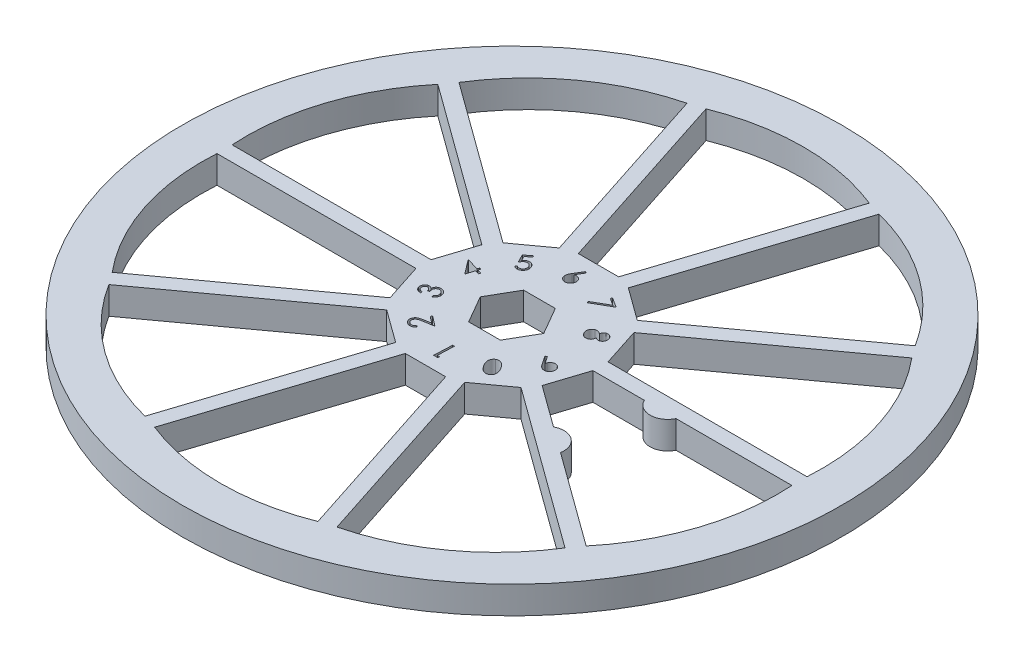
from build123d import *

# Parameters (mm, degrees)
SKETCH1_R           = 38.1
BOSS_EXTRUDE1_DEPTH = 3.175
CUT_EXTRUDE1_DEPTH  = 54.975
BOSS_EXTRUDE3_DEPTH = 3.175


with BuildPart() as part:
    # Sketch1 → Boss-Extrude1 (new body)
    with BuildSketch(Plane(origin=(0, 0, 0), x_dir=(1, 0, 0), z_dir=(0, 1, 0))):
        with Locations(Location((0, 0, 0), (0, 0, 270))):
            Circle(SKETCH1_R)
        with BuildLine():
            Line((-9.436558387, 31.874299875), (-2.329167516, 10))
            Line((-2.329167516, 10), (2.329167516, 10))
            Line((2.329167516, 10), (9.436558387, 31.874299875))
            ThreePointArc((9.436558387, 31.874299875), (0, 33.692286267), (-9.436558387, 31.874299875))
        make_face(mode=Mode.SUBTRACT)
        with BuildLine():
            Line((-3.99351642, 9.45922026), (-7.762188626, 6.721119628))
            Line((-7.762188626, 6.721119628), (-26.369579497, 20.24018043))
            ThreePointArc((-26.369579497, 20.24018043), (-19.803828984, 27.257632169), (-11.10090729, 31.333520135))
            Line((-11.10090729, 31.333520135), (-3.99351642, 9.45922026))
        make_face(mode=Mode.SUBTRACT)
        with BuildLine():
            Line((7.762188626, 6.721119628), (3.99351642, 9.45922026))
            Line((3.99351642, 9.45922026), (11.10090729, 31.333520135))
            ThreePointArc((11.10090729, 31.333520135), (19.803828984, 27.257632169), (26.369579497, 20.24018043))
            Line((26.369579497, 20.24018043), (7.762188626, 6.721119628))
        make_face(mode=Mode.SUBTRACT)
        with BuildLine():
            Line((-10.230317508, -0.875), (-8.790812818, -5.305339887))
            Line((-8.790812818, -5.305339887), (-27.398203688, -18.82440069))
            ThreePointArc((-27.398203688, -18.82440069), (-32.043268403, -10.411489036), (-33.230317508, -0.875))
            Line((-33.230317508, -0.875), (-10.230317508, -0.875))
        make_face(mode=Mode.SUBTRACT)
        with BuildLine():
            Line((8.790812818, -5.305339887), (10.230317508, -0.875))
            Line((10.230317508, -0.875), (33.230317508, -0.875))
            ThreePointArc((33.230317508, -0.875), (32.043268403, -10.411489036), (27.398203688, -18.82440069))
            Line((27.398203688, -18.82440069), (8.790812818, -5.305339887))
        make_face(mode=Mode.SUBTRACT)
        with BuildLine():
            Line((-2.329167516, -10), (2.329167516, -10))
            Line((2.329167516, -10), (9.436558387, -31.874299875))
            ThreePointArc((9.436558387, -31.874299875), (0, -33.692286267), (-9.436558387, -31.874299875))
            Line((-9.436558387, -31.874299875), (-2.329167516, -10))
        make_face(mode=Mode.SUBTRACT)
        with BuildLine():
            Line((-27.398203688, 18.82440069), (-8.790812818, 5.305339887))
            Line((-8.790812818, 5.305339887), (-10.230317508, 0.875))
            Line((-10.230317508, 0.875), (-33.230317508, 0.875))
            ThreePointArc((-33.230317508, 0.875), (-32.043268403, 10.411489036), (-27.398203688, 18.82440069))
        make_face(mode=Mode.SUBTRACT)
        with BuildLine():
            Line((-3.99351642, -9.45922026), (-7.762188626, -6.721119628))
            Line((-7.762188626, -6.721119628), (-26.369579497, -20.24018043))
            ThreePointArc((-26.369579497, -20.24018043), (-19.803828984, -27.257632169), (-11.10090729, -31.333520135))
            Line((-11.10090729, -31.333520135), (-3.99351642, -9.45922026))
        make_face(mode=Mode.SUBTRACT)
        with BuildLine():
            Line((8.790812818, 5.305339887), (10.230317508, 0.875))
            Line((10.230317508, 0.875), (33.230317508, 0.875))
            ThreePointArc((33.230317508, 0.875), (32.043268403, 10.411489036), (27.398203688, 18.82440069))
            Line((27.398203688, 18.82440069), (8.790812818, 5.305339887))
        make_face(mode=Mode.SUBTRACT)
        with BuildLine():
            Line((7.762188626, -6.721119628), (3.99351642, -9.45922026))
            Line((3.99351642, -9.45922026), (11.10090729, -31.333520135))
            ThreePointArc((11.10090729, -31.333520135), (19.803828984, -27.257632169), (26.369579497, -20.24018043))
            Line((26.369579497, -20.24018043), (7.762188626, -6.721119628))
        make_face(mode=Mode.SUBTRACT)
        Polygon((3.666174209, 0), (1.833087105, 3.175), (-1.833087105, 3.175), (-3.666174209, 0), (-1.833087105, -3.175), (1.833087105, -3.175), align=None, mode=Mode.SUBTRACT)
    extrude(amount=BOSS_EXTRUDE1_DEPTH)

    # Sketch4 → Cut-Extrude1 (cut, through all)
    # profile 1 of 10: a face of its own
    with BuildSketch(Plane(origin=(0, 3.175, 0), x_dir=(1, 0, 0), z_dir=(0, 1, 0))):
        with BuildLine():
            Line((6.008134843, -2.207274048), (6.177739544, -2.089822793))
            Line((6.177739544, -2.089822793), (6.758211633, -2.944630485))
            add(Edge.make_bspline(
                [(6.758211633, -2.944630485), (6.759998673, -2.925079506), (6.763474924, -2.887047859), (6.774121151, -2.832025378), (6.787033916, -2.780153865), (6.79957908, -2.747641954), (6.805700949, -2.731776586)],
                knots=[0, 0, 0, 0, 1.075315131, 2.091762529, 3.068806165, 4, 4, 4, 4], degree=3))
            add(Edge.make_bspline(
                [(6.805700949, -2.731776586), (6.814114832, -2.712946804), (6.830622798, -2.676002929), (6.861067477, -2.624206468), (6.895968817, -2.576829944), (6.93547794, -2.534024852), (6.979105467, -2.495536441), (7.026933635, -2.461337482), (7.079339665, -2.431783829), (7.135292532, -2.406331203), (7.193818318, -2.386944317), (7.25294362, -2.371809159), (7.312752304, -2.364676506), (7.37280331, -2.362097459), (7.433253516, -2.366845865), (7.494165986, -2.376191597), (7.555058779, -2.393146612), (7.594897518, -2.408226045), (7.615139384, -2.41588783)],
                knots=[0, 0, 0, 0, 1.022013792, 2.005182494, 2.97231041, 3.934474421, 4.887767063, 5.852327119, 6.844124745, 7.866642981, 8.894932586, 9.89776092, 10.886955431, 11.875703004, 12.873302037, 13.888324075, 14.92706791, 16, 16, 16, 16], degree=3))
            add(Edge.make_bspline(
                [(7.615139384, -2.41588783), (7.642252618, -2.427997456), (7.69550017, -2.451779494), (7.767460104, -2.499863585), (7.831918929, -2.554778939), (7.887467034, -2.617883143), (7.9344972, -2.68733619), (7.970479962, -2.763279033), (7.997382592, -2.844220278), (8.01225277, -2.929759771), (8.018329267, -3.017010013), (8.011970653, -3.103897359), (7.99559219, -3.18956788), (7.975215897, -3.244078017), (7.96494908, -3.271543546)],
                knots=[0, 0, 0, 0, 1.036517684, 2.035612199, 3.013201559, 3.989841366, 4.965618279, 5.935849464, 6.918719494, 7.938327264, 8.963189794, 9.968654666, 10.976484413, 12, 12, 12, 12], degree=3))
            add(Edge.make_bspline(
                [(7.96494908, -3.271543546), (7.953007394, -3.297601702), (7.929392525, -3.349132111), (7.883005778, -3.42015218), (7.827837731, -3.483771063), (7.764704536, -3.539697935), (7.695005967, -3.58667744), (7.619724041, -3.623714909), (7.539702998, -3.650143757), (7.455893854, -3.665037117), (7.370871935, -3.669755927), (7.286493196, -3.663939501), (7.203629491, -3.64695365), (7.150782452, -3.627680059), (7.124133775, -3.617961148)],
                knots=[0, 0, 0, 0, 1.01839986, 2.013901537, 3.004594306, 4.005222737, 5.004853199, 5.985019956, 6.980115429, 7.991731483, 9.003622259, 10.001405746, 10.99218778, 12, 12, 12, 12], degree=3))
            add(Edge.make_bspline(
                [(7.124133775, -3.617961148), (7.103996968, -3.609044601), (7.063097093, -3.590934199), (7.004458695, -3.55542633), (6.946830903, -3.513795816), (6.889198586, -3.464959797), (6.831284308, -3.406042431), (6.771386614, -3.335849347), (6.708385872, -3.253625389), (6.667446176, -3.193463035), (6.645848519, -3.161724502)],
                knots=[0, 0, 0, 0, 0.787036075, 1.59854923, 2.445988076, 3.328266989, 4.297018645, 5.397528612, 6.627071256, 8, 8, 8, 8], degree=3))
            Line((6.645848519, -3.161724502), (6.008134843, -2.207274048))
        make_face()
        with BuildLine():
            add(Edge.make_bspline(
                [(6.95834518, -2.847107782), (6.952989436, -2.861294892), (6.942472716, -2.889153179), (6.931447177, -2.932053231), (6.924479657, -2.974773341), (6.922503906, -3.017701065), (6.924432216, -3.060493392), (6.931469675, -3.103213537), (6.942557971, -3.145787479), (6.957709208, -3.187807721), (6.976574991, -3.22836067), (6.99915169, -3.265942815), (7.024219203, -3.300999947), (7.053299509, -3.332077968), (7.084809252, -3.360938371), (7.119674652, -3.386315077), (7.1576361, -3.408574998), (7.184642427, -3.420622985), (7.198335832, -3.426731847)],
                knots=[0, 0, 0, 0, 1.04241003, 2.04691155, 3.041056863, 4.014450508, 4.997553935, 5.98209837, 6.98659989, 8.019857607, 9.050596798, 10.057635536, 11.031854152, 12.008882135, 12.979358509, 13.967161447, 14.969260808, 16, 16, 16, 16], degree=3))
            add(Edge.make_bspline(
                [(7.198335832, -3.426731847), (7.212380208, -3.432084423), (7.240078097, -3.442640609), (7.282683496, -3.453715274), (7.325332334, -3.460060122), (7.367935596, -3.462185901), (7.410590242, -3.460186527), (7.453169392, -3.453186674), (7.495742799, -3.442093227), (7.537766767, -3.42694772), (7.578305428, -3.408064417), (7.616108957, -3.385448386), (7.651210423, -3.359957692), (7.683006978, -3.331063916), (7.711642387, -3.299131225), (7.736716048, -3.263819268), (7.759464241, -3.2258657), (7.771465, -3.198476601), (7.777535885, -3.184621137)],
                knots=[0, 0, 0, 0, 1.032325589, 2.035920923, 3.01808944, 3.990604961, 4.963120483, 5.946776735, 6.950372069, 7.982697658, 9.012506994, 10.018637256, 11.005549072, 11.988869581, 12.965692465, 13.946899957, 14.96138774, 16, 16, 16, 16], degree=3))
            add(Edge.make_bspline(
                [(7.777535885, -3.184621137), (7.782888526, -3.170576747), (7.793444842, -3.142878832), (7.804518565, -3.100273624), (7.810866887, -3.057624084), (7.81297986, -3.015023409), (7.811034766, -2.972498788), (7.803901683, -2.930091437), (7.793020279, -2.887543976), (7.777216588, -2.84570235), (7.758450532, -2.805086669), (7.73598684, -2.767285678), (7.710138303, -2.73274507), (7.682067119, -2.700591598), (7.649609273, -2.672704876), (7.614988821, -2.647052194), (7.576958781, -2.624864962), (7.549961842, -2.612807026), (7.536273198, -2.606693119)],
                knots=[0, 0, 0, 0, 1.035134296, 2.041460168, 3.026300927, 4.001462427, 4.976623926, 5.953340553, 6.959666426, 7.998140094, 9.030751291, 10.039618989, 11.021372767, 12.000853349, 12.97387249, 13.963469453, 14.967388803, 16, 16, 16, 16], degree=3))
            add(Edge.make_bspline(
                [(7.536273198, -2.606693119), (7.522228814, -2.601340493), (7.494530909, -2.590784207), (7.451925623, -2.579710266), (7.40927637, -2.573362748), (7.366674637, -2.571246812), (7.324153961, -2.573202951), (7.281731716, -2.580294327), (7.239289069, -2.591325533), (7.197267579, -2.606480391), (7.156723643, -2.625354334), (7.119107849, -2.647895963), (7.084249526, -2.673035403), (7.05270375, -2.701635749), (7.024303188, -2.733592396), (6.998734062, -2.768420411), (6.976509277, -2.806414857), (6.964456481, -2.833416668), (6.95834518, -2.847107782)],
                knots=[0, 0, 0, 0, 1.035774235, 2.042722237, 3.028171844, 4.003936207, 4.97970057, 5.957021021, 6.963969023, 7.999743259, 9.032992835, 10.042484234, 11.019075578, 11.991915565, 12.972001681, 13.962210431, 14.966750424, 16, 16, 16, 16], degree=3))
        make_face(mode=Mode.SUBTRACT)
    # profile 2 of 10: a face of its own
    with BuildSketch(Plane(origin=(0, 3.175, 0), x_dir=(1, 0, 0), z_dir=(0, 1, 0))):
        with BuildLine():
            add(Edge.make_bspline(
                [(4.646652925, -5.931807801), (4.664653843, -5.960382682), (4.699634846, -6.015911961), (4.747354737, -6.098619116), (4.790166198, -6.177405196), (4.826609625, -6.253248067), (4.858252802, -6.325337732), (4.883533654, -6.394290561), (4.904552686, -6.459292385), (4.918854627, -6.521510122), (4.928559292, -6.581183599), (4.935235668, -6.638614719), (4.93732577, -6.694605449), (4.935504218, -6.74883383), (4.930801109, -6.801640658), (4.921102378, -6.85256161), (4.908739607, -6.902089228), (4.891437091, -6.949348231), (4.871669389, -6.994993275), (4.848359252, -7.037995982), (4.822277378, -7.078671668), (4.793328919, -7.117034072), (4.761282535, -7.153082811), (4.725658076, -7.186019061), (4.688011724, -7.2175363), (4.660548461, -7.235754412), (4.646652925, -7.244972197)],
                knots=[0, 0, 0, 0, 1.645831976, 3.198328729, 4.653025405, 6.014789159, 7.298288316, 8.488304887, 9.592894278, 10.625525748, 11.596046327, 12.538562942, 13.441613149, 14.323771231, 15.181935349, 16.02233202, 16.84768784, 17.666926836, 18.471967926, 19.270231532, 20.04793037, 20.824957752, 21.610397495, 22.394990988, 23.187916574, 24, 24, 24, 24], degree=3))
            add(Edge.make_bspline(
                [(4.646652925, -7.244972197), (4.632210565, -7.253659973), (4.603571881, -7.270887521), (4.558936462, -7.292877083), (4.513552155, -7.31141686), (4.46682123, -7.325096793), (4.419388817, -7.336574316), (4.370656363, -7.343114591), (4.321058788, -7.345990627), (4.270734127, -7.345775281), (4.219812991, -7.341051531), (4.168660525, -7.331997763), (4.117234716, -7.318998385), (4.065880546, -7.300751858), (4.014072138, -7.279250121), (3.96212162, -7.253337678), (3.910543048, -7.222396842), (3.858035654, -7.188211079), (3.805463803, -7.14844253), (3.753195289, -7.102535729), (3.700437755, -7.051113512), (3.647904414, -6.993565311), (3.594917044, -6.93028461), (3.541542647, -6.861156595), (3.488038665, -6.78607171), (3.453708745, -6.733182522), (3.436099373, -6.70605326)],
                knots=[0, 0, 0, 0, 0.815853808, 1.617808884, 2.407075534, 3.186547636, 3.973496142, 4.768174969, 5.563560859, 6.378064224, 7.202826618, 8.036627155, 8.8915378, 9.768172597, 10.673203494, 11.606770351, 12.576348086, 13.584347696, 14.639750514, 15.765220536, 16.951028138, 18.2056322, 19.536778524, 20.946858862, 22.433905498, 24, 24, 24, 24], degree=3))
            add(Edge.make_bspline(
                [(3.436099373, -6.70605326), (3.418942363, -6.678753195), (3.385580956, -6.625668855), (3.340039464, -6.546033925), (3.299818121, -6.469043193), (3.264567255, -6.394803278), (3.233984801, -6.323432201), (3.209598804, -6.254353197), (3.189676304, -6.188096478), (3.175613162, -6.124127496), (3.166580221, -6.062444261), (3.160134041, -6.002902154), (3.15878161, -5.94509298), (3.160059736, -5.889115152), (3.166132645, -5.834970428), (3.176008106, -5.782742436), (3.188897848, -5.73196885), (3.20648032, -5.683324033), (3.227187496, -5.636704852), (3.250926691, -5.592663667), (3.27741237, -5.551018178), (3.307112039, -5.512065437), (3.339870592, -5.475496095), (3.375483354, -5.441471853), (3.414374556, -5.410343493), (3.442041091, -5.391709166), (3.456027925, -5.38228857)],
                knots=[0, 0, 0, 0, 1.562310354, 3.03787612, 4.44395277, 5.770467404, 7.019601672, 8.204525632, 9.318421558, 10.370311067, 11.374754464, 12.338370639, 13.270212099, 14.174670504, 15.049738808, 15.906744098, 16.748953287, 17.585125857, 18.409860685, 19.218832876, 20.007279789, 20.799021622, 21.589607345, 22.384069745, 23.183065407, 24, 24, 24, 24], degree=3))
            add(Edge.make_bspline(
                [(3.456027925, -5.38228857), (3.470162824, -5.373559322), (3.498234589, -5.356223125), (3.542375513, -5.334858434), (3.587289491, -5.316873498), (3.632845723, -5.302304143), (3.679602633, -5.292260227), (3.727050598, -5.285345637), (3.775552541, -5.282429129), (3.824739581, -5.283313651), (3.874519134, -5.287940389), (3.924474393, -5.296773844), (3.974358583, -5.310326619), (4.024511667, -5.32689591), (4.074164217, -5.349154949), (4.124478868, -5.374302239), (4.174255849, -5.404791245), (4.224911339, -5.43875031), (4.275625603, -5.478577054), (4.326757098, -5.524445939), (4.37876556, -5.57648179), (4.43112742, -5.635168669), (4.484587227, -5.699994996), (4.538287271, -5.771525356), (4.593131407, -5.848985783), (4.628480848, -5.903687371), (4.646652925, -5.931807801)],
                knots=[0, 0, 0, 0, 0.810485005, 1.609614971, 2.389818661, 3.17096737, 3.9409775, 4.72151665, 5.509490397, 6.3098999, 7.120649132, 7.947529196, 8.782571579, 9.642161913, 10.522704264, 11.435989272, 12.386082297, 13.369627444, 14.411590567, 15.530535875, 16.720858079, 18.000814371, 19.368238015, 20.821189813, 22.365869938, 24, 24, 24, 24], degree=3))
        make_face()
        with BuildLine():
            add(Edge.make_bspline(
                [(4.477048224, -6.03569068), (4.461336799, -6.011584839), (4.430874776, -5.964847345), (4.384673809, -5.898223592), (4.339654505, -5.837300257), (4.296712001, -5.781252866), (4.253866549, -5.731915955), (4.212529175, -5.687959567), (4.172992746, -5.649190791), (4.122303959, -5.606353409), (4.059293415, -5.562604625), (3.982412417, -5.521661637), (3.904429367, -5.494758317), (3.826538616, -5.482243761), (3.751238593, -5.481369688), (3.679737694, -5.490796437), (3.612804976, -5.511945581), (3.572716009, -5.534631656), (3.552702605, -5.545957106)],
                knots=[0, 0, 0, 0, 1.181714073, 2.291160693, 3.329086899, 4.292828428, 5.190029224, 6.011310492, 6.770753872, 7.462710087, 8.734792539, 9.913537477, 11.029615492, 12.106059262, 13.139365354, 14.112154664, 15.057540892, 16, 16, 16, 16], degree=3))
            add(Edge.make_bspline(
                [(3.552702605, -5.545957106), (3.533742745, -5.559266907), (3.495894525, -5.585836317), (3.449291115, -5.638313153), (3.409655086, -5.697727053), (3.3845157, -5.753620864), (3.369314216, -5.801765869), (3.360967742, -5.839948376), (3.355245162, -5.879484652), (3.353557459, -5.920474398), (3.353474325, -5.96287331), (3.35839661, -6.006697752), (3.36469003, -6.052122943), (3.371826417, -6.082519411), (3.375465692, -6.098020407)],
                knots=[0, 0, 0, 0, 1.339326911, 2.673603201, 4.03984646, 5.470463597, 6.209276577, 6.964946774, 7.734622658, 8.522543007, 9.342223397, 10.190421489, 11.077186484, 12, 12, 12, 12], degree=3))
            add(Edge.make_bspline(
                [(3.375465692, -6.098020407), (3.380323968, -6.117589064), (3.390191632, -6.157335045), (3.409612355, -6.216842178), (3.432615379, -6.277443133), (3.458868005, -6.339282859), (3.488677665, -6.402245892), (3.522143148, -6.466212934), (3.559602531, -6.531121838), (3.586495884, -6.574263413), (3.600191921, -6.596234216)],
                knots=[0, 0, 0, 0, 0.881068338, 1.78954166, 2.733856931, 3.713774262, 4.725199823, 5.77800347, 6.868398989, 8, 8, 8, 8], degree=3))
            add(Edge.make_bspline(
                [(3.600191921, -6.596234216), (3.614348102, -6.617938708), (3.64197834, -6.660301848), (3.684447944, -6.721027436), (3.726719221, -6.777700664), (3.769667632, -6.829461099), (3.811504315, -6.877946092), (3.854128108, -6.921512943), (3.896182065, -6.961411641), (3.938483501, -6.996813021), (3.980402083, -7.028214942), (4.021929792, -7.05574057), (4.062824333, -7.079839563), (4.103521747, -7.099803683), (4.14398596, -7.115877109), (4.183669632, -7.128911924), (4.223215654, -7.13732462), (4.274252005, -7.144086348), (4.336254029, -7.144204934), (4.407123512, -7.134105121), (4.473771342, -7.113837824), (4.513310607, -7.090993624), (4.533017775, -7.079607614)],
                knots=[0, 0, 0, 0, 1.330078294, 2.596065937, 3.80331419, 4.957991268, 6.047946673, 7.089475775, 8.085195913, 9.022479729, 9.919210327, 10.772385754, 11.578713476, 12.354194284, 13.096521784, 13.81239025, 14.49544863, 15.168571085, 16.45274294, 17.662430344, 18.834908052, 20, 20, 20, 20], degree=3))
            add(Edge.make_bspline(
                [(4.533017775, -7.079607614), (4.551939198, -7.066264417), (4.589789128, -7.039573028), (4.637042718, -6.987472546), (4.67612162, -6.927149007), (4.70103527, -6.870696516), (4.716800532, -6.822117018), (4.725744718, -6.78368549), (4.731007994, -6.74378164), (4.734255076, -6.702717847), (4.733538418, -6.660196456), (4.730294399, -6.616254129), (4.723186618, -6.571169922), (4.713968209, -6.524204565), (4.700519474, -6.474910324), (4.68273882, -6.422299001), (4.659460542, -6.366514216), (4.632391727, -6.307004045), (4.60027979, -6.244212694), (4.563955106, -6.177582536), (4.522113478, -6.107775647), (4.492391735, -6.060233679), (4.477048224, -6.03569068)],
                knots=[0, 0, 0, 0, 1.185349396, 2.371142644, 3.582401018, 4.861775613, 5.524760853, 6.202231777, 6.88342084, 7.58889689, 8.314341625, 9.063762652, 9.848579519, 10.655219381, 11.519217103, 12.46892058, 13.503486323, 14.620144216, 15.823732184, 17.122294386, 18.514417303, 20, 20, 20, 20], degree=3))
        make_face(mode=Mode.SUBTRACT)
    # profile 3 of 10: a face of its own
    with BuildSketch(Plane(origin=(0, 3.175, 0), x_dir=(1, 0, 0), z_dir=(0, 1, 0))):
        Polygon((-0.096389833, -8.560304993), (-0.510225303, -8.542920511), (-0.421606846, -6.437702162), (-0.212569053, -6.446606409), (-0.292283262, -8.345755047), (0.038445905, -8.359747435), align=None)
    # profile 4 of 10: a face of its own
    with BuildSketch(Plane(origin=(0, 3.175, 0), x_dir=(1, 0, 0), z_dir=(0, 1, 0))):
        with BuildLine():
            Line((-4.432784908, -6.555224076), (-4.272084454, -6.678611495))
            add(Edge.make_bspline(
                [(-4.272084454, -6.678611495), (-4.288747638, -6.698101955), (-4.32139403, -6.736287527), (-4.374584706, -6.788037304), (-4.430999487, -6.832573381), (-4.489513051, -6.871705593), (-4.551289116, -6.903333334), (-4.615371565, -6.929164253), (-4.682189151, -6.948162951), (-4.750905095, -6.960833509), (-4.820208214, -6.966758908), (-4.888667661, -6.965995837), (-4.955750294, -6.958369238), (-5.021160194, -6.943747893), (-5.085314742, -6.923145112), (-5.147303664, -6.894517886), (-5.208611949, -6.86039639), (-5.246882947, -6.832388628), (-5.266392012, -6.818111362)],
                knots=[0, 0, 0, 0, 1.100149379, 2.155404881, 3.178494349, 4.181169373, 5.171382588, 6.151324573, 7.141983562, 8.147297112, 9.145688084, 10.122339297, 11.080890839, 12.037502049, 12.994670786, 13.966544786, 14.963423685, 16, 16, 16, 16], degree=3))
            add(Edge.make_bspline(
                [(-5.266392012, -6.818111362), (-5.284896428, -6.803157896), (-5.321055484, -6.773937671), (-5.36973623, -6.725642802), (-5.41205071, -6.674813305), (-5.447107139, -6.620795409), (-5.477525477, -6.565190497), (-5.5001583, -6.506349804), (-5.517019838, -6.44515282), (-5.526781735, -6.381980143), (-5.531141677, -6.318543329), (-5.52931742, -6.256102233), (-5.5223844, -6.195408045), (-5.508956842, -6.136542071), (-5.490389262, -6.079329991), (-5.465435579, -6.02412847), (-5.435477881, -5.970182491), (-5.411061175, -5.936636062), (-5.398683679, -5.919630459)],
                knots=[0, 0, 0, 0, 1.125548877, 2.199409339, 3.240166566, 4.24957425, 5.243251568, 6.234651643, 7.22627742, 8.242556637, 9.254974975, 10.232096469, 11.195517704, 12.141759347, 13.085324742, 14.03767207, 15.005242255, 16, 16, 16, 16], degree=3))
            add(Edge.make_bspline(
                [(-5.398683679, -5.919630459), (-5.379898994, -5.89676072), (-5.342666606, -5.851431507), (-5.276831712, -5.79317008), (-5.204684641, -5.743522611), (-5.138403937, -5.709613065), (-5.079785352, -5.686256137), (-5.029446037, -5.668512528), (-4.972972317, -5.651252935), (-4.910475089, -5.634266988), (-4.841680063, -5.617935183), (-4.766795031, -5.601372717), (-4.685785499, -5.585283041), (-4.629687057, -5.575368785), (-4.600693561, -5.570244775)],
                knots=[0, 0, 0, 0, 1.19032024, 2.359287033, 3.526020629, 4.709749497, 5.348159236, 6.06644772, 6.858627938, 7.725764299, 8.674200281, 9.705837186, 10.814302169, 12, 12, 12, 12], degree=3))
            Line((-4.600693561, -5.570244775), (-3.838320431, -5.440497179))
            Line((-3.838320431, -5.440497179), (-4.612141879, -4.846880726))
            Line((-4.612141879, -4.846880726), (-4.487906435, -4.684908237))
            Line((-4.487906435, -4.684908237), (-3.349434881, -5.558372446))
            Line((-3.349434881, -5.558372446), (-4.520131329, -5.758930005))
            add(Edge.make_bspline(
                [(-4.520131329, -5.758930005), (-4.54854643, -5.763840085), (-4.603295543, -5.773300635), (-4.681952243, -5.787498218), (-4.753765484, -5.801920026), (-4.818661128, -5.816297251), (-4.876698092, -5.830478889), (-4.927777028, -5.845129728), (-4.972237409, -5.85869336), (-5.021781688, -5.877197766), (-5.076562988, -5.903509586), (-5.135683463, -5.942107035), (-5.188994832, -5.987325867), (-5.218547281, -6.023044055), (-5.233319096, -6.04089782)],
                knots=[0, 0, 0, 0, 1.320310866, 2.543923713, 3.659492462, 4.673759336, 5.587226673, 6.394355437, 7.106613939, 7.714816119, 8.814657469, 9.880838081, 10.940735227, 12, 12, 12, 12], degree=3))
            add(Edge.make_bspline(
                [(-5.233319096, -6.04089782), (-5.24191783, -6.052743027), (-5.258886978, -6.076118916), (-5.279576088, -6.113751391), (-5.296491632, -6.152399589), (-5.30798111, -6.19271991), (-5.316947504, -6.23386884), (-5.320508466, -6.276718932), (-5.320067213, -6.320719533), (-5.315427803, -6.365447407), (-5.306532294, -6.409713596), (-5.293858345, -6.452610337), (-5.277385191, -6.493450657), (-5.256611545, -6.53213664), (-5.232226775, -6.568919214), (-5.203475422, -6.603398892), (-5.171065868, -6.636025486), (-5.146876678, -6.655514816), (-5.134524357, -6.665467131)],
                knots=[0, 0, 0, 0, 0.998093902, 1.969685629, 2.92471149, 3.87082952, 4.826196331, 5.794718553, 6.797973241, 7.825964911, 8.85887793, 9.875217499, 10.874755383, 11.858671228, 12.867290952, 13.881293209, 14.918072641, 16, 16, 16, 16], degree=3))
            add(Edge.make_bspline(
                [(-5.134524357, -6.665467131), (-5.121107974, -6.675161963), (-5.094698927, -6.694245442), (-5.053115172, -6.718546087), (-5.010432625, -6.73776632), (-4.966903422, -6.75212129), (-4.922690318, -6.76268893), (-4.877420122, -6.76741431), (-4.831406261, -6.768583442), (-4.784821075, -6.764074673), (-4.73803111, -6.755305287), (-4.691880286, -6.741237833), (-4.646557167, -6.722265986), (-4.601867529, -6.698948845), (-4.558038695, -6.670349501), (-4.515307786, -6.636456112), (-4.47258305, -6.598563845), (-4.44624936, -6.569886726), (-4.432784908, -6.555224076)],
                knots=[0, 0, 0, 0, 1.00430334, 1.976888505, 2.917624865, 3.839993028, 4.755634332, 5.670793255, 6.597460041, 7.54501695, 8.505725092, 9.482726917, 10.467307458, 11.484173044, 12.538281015, 13.638306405, 14.792462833, 16, 16, 16, 16], degree=3))
        make_face()
    # profile 5 of 10: a face of its own
    with BuildSketch(Plane(origin=(0, 3.175, 0), x_dir=(1, 0, 0), z_dir=(0, 1, 0))):
        with BuildLine():
            Line((-7.565496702, -2.829563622), (-7.501046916, -3.034361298))
            add(Edge.make_bspline(
                [(-7.501046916, -3.034361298), (-7.522803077, -3.035798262), (-7.565300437, -3.038605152), (-7.628067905, -3.03757569), (-7.688355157, -3.032805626), (-7.745989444, -3.022842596), (-7.801252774, -3.009392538), (-7.853891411, -2.991307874), (-7.903674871, -2.967944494), (-7.951144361, -2.9415616), (-7.99528649, -2.910998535), (-8.035671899, -2.876848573), (-8.072717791, -2.839848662), (-8.106327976, -2.799938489), (-8.136296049, -2.756865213), (-8.161942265, -2.710366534), (-8.184891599, -2.661079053), (-8.196478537, -2.626309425), (-8.202362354, -2.608653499)],
                knots=[0, 0, 0, 0, 1.171238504, 2.287836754, 3.370199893, 4.417814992, 5.427291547, 6.424116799, 7.402837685, 8.378843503, 9.339569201, 10.28287391, 11.217361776, 12.149964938, 13.083310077, 14.032011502, 15.000660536, 16, 16, 16, 16], degree=3))
            add(Edge.make_bspline(
                [(-8.202362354, -2.608653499), (-8.209664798, -2.582652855), (-8.224142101, -2.531105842), (-8.23413508, -2.451641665), (-8.233967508, -2.372208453), (-8.224755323, -2.29361638), (-8.206374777, -2.21760588), (-8.178727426, -2.146289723), (-8.142316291, -2.080673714), (-8.097802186, -2.021474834), (-8.04692814, -1.969471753), (-7.990648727, -1.926352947), (-7.930693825, -1.890920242), (-7.887340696, -1.875568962), (-7.865697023, -1.867904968)],
                knots=[0, 0, 0, 0, 1.075905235, 2.133012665, 3.181428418, 4.237152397, 5.28162113, 6.291729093, 7.278286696, 8.264699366, 9.23724505, 10.169628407, 11.086202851, 12, 12, 12, 12], degree=3))
            add(Edge.make_bspline(
                [(-7.865697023, -1.867904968), (-7.844348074, -1.86189963), (-7.802444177, -1.850112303), (-7.738057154, -1.843513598), (-7.674676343, -1.846053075), (-7.612164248, -1.857698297), (-7.550478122, -1.878280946), (-7.489908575, -1.908495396), (-7.4301808, -1.947739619), (-7.393010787, -1.979551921), (-7.37384339, -1.995956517)],
                knots=[0, 0, 0, 0, 0.994688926, 1.952383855, 2.892751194, 3.835366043, 4.799018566, 5.804107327, 6.867647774, 8, 8, 8, 8], degree=3))
            add(Edge.make_bspline(
                [(-7.37384339, -1.995956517), (-7.370852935, -1.96940386), (-7.364961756, -1.917095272), (-7.344384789, -1.84154662), (-7.315929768, -1.769821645), (-7.289527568, -1.726104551), (-7.276320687, -1.704236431)],
                knots=[0, 0, 0, 0, 1.030676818, 2.03042766, 3.01478259, 4, 4, 4, 4], degree=3))
            add(Edge.make_bspline(
                [(-7.276320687, -1.704236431), (-7.266402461, -1.689627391), (-7.246729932, -1.66065076), (-7.213048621, -1.621061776), (-7.177397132, -1.584679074), (-7.139072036, -1.552304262), (-7.098083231, -1.523821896), (-7.054765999, -1.498709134), (-7.008826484, -1.477251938), (-6.976658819, -1.466352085), (-6.960431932, -1.460853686)],
                knots=[0, 0, 0, 0, 1.040428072, 2.063660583, 3.05951573, 4.04114841, 5.016713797, 5.99866477, 6.990432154, 8, 8, 8, 8], degree=3))
            add(Edge.make_bspline(
                [(-6.960431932, -1.460853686), (-6.931915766, -1.452902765), (-6.875020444, -1.437039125), (-6.786322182, -1.429060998), (-6.696394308, -1.431178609), (-6.621444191, -1.444052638), (-6.561839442, -1.459014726), (-6.518146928, -1.473369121), (-6.476073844, -1.490988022), (-6.4354331, -1.510696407), (-6.39649166, -1.533426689), (-6.359274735, -1.558845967), (-6.323412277, -1.587011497), (-6.277867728, -1.628129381), (-6.22556827, -1.685355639), (-6.171884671, -1.762298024), (-6.1270562, -1.847277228), (-6.105830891, -1.908427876), (-6.095023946, -1.939562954)],
                knots=[0, 0, 0, 0, 1.287151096, 2.568117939, 3.861540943, 5.196567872, 5.870010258, 6.537800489, 7.197510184, 7.855580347, 8.503930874, 9.159664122, 9.817359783, 10.488688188, 11.830921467, 13.183647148, 14.566043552, 16, 16, 16, 16], degree=3))
            add(Edge.make_bspline(
                [(-6.095023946, -1.939562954), (-6.088674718, -1.960803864), (-6.076183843, -2.002591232), (-6.064823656, -2.066015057), (-6.057478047, -2.127913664), (-6.056998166, -2.18880699), (-6.06076195, -2.248488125), (-6.071373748, -2.306878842), (-6.086464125, -2.364228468), (-6.10784562, -2.419893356), (-6.134045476, -2.474245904), (-6.166565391, -2.525817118), (-6.203934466, -2.575533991), (-6.247662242, -2.621960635), (-6.296054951, -2.666905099), (-6.350625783, -2.708695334), (-6.410598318, -2.748323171), (-6.453425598, -2.77204409), (-6.475362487, -2.784194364)],
                knots=[0, 0, 0, 0, 1.044301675, 2.054460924, 3.033078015, 3.979313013, 4.921150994, 5.847878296, 6.772375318, 7.712868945, 8.654518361, 9.612225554, 10.582368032, 11.581901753, 12.614575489, 13.692761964, 14.818191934, 16, 16, 16, 16], degree=3))
            Line((-6.475362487, -2.784194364), (-6.537268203, -2.587876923))
            add(Edge.make_bspline(
                [(-6.537268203, -2.587876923), (-6.522873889, -2.578581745), (-6.494821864, -2.560467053), (-6.456017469, -2.531244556), (-6.421114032, -2.501734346), (-6.389324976, -2.472646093), (-6.361927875, -2.442498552), (-6.337925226, -2.412323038), (-6.317655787, -2.381777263), (-6.3071027, -2.360440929), (-6.301941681, -2.35000633)],
                knots=[0, 0, 0, 0, 1.212756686, 2.36345273, 3.435782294, 4.448175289, 5.411358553, 6.316173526, 7.176519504, 8, 8, 8, 8], degree=3))
            add(Edge.make_bspline(
                [(-6.301941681, -2.35000633), (-6.296462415, -2.336670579), (-6.28555712, -2.310128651), (-6.273645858, -2.268667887), (-6.265995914, -2.226050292), (-6.26261346, -2.182297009), (-6.263633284, -2.13760073), (-6.268306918, -2.091924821), (-6.277127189, -2.045208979), (-6.286264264, -2.014261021), (-6.290917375, -1.998500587)],
                knots=[0, 0, 0, 0, 0.961111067, 1.912883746, 2.87075297, 3.844677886, 4.834712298, 5.848737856, 6.904456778, 8, 8, 8, 8], degree=3))
            add(Edge.make_bspline(
                [(-6.290917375, -1.998500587), (-6.297010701, -1.980873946), (-6.308933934, -1.946382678), (-6.33094473, -1.897432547), (-6.356588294, -1.852719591), (-6.385032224, -1.811670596), (-6.416862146, -1.774563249), (-6.45240474, -1.741729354), (-6.491009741, -1.712796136), (-6.532537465, -1.688372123), (-6.575540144, -1.668288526), (-6.618837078, -1.651918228), (-6.662438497, -1.640329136), (-6.706212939, -1.633522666), (-6.75013484, -1.631366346), (-6.794047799, -1.633956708), (-6.838079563, -1.641202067), (-6.866931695, -1.649265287), (-6.881565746, -1.653355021)],
                knots=[0, 0, 0, 0, 1.171811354, 2.29296428, 3.367246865, 4.407191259, 5.427563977, 6.433292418, 7.442428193, 8.454024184, 9.455427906, 10.422353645, 11.359649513, 12.285595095, 13.201644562, 14.118167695, 15.045518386, 16, 16, 16, 16], degree=3))
            add(Edge.make_bspline(
                [(-6.881565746, -1.653355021), (-6.900613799, -1.660284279), (-6.93855689, -1.674087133), (-6.99106043, -1.704852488), (-7.039036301, -1.742954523), (-7.081544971, -1.788225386), (-7.117905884, -1.838969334), (-7.147299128, -1.893988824), (-7.167372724, -1.953208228), (-7.178406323, -2.005141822), (-7.1823192, -2.049742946), (-7.18245454, -2.086854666), (-7.180835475, -2.127341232), (-7.17641199, -2.171197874), (-7.16958548, -2.218578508), (-7.160248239, -2.269356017), (-7.148150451, -2.323432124), (-7.139012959, -2.360482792), (-7.13427675, -2.379687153)],
                knots=[0, 0, 0, 0, 1.125656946, 2.242271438, 3.367021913, 4.523877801, 5.68462785, 6.831151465, 7.979910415, 9.151790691, 9.775346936, 10.467275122, 11.214856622, 12.028482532, 12.918001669, 13.877203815, 14.899697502, 16, 16, 16, 16], degree=3))
            Line((-7.13427675, -2.379687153), (-7.318297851, -2.437776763))
            add(Edge.make_bspline(
                [(-7.318297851, -2.437776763), (-7.325865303, -2.415390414), (-7.34072771, -2.371423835), (-7.370986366, -2.309937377), (-7.405148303, -2.252846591), (-7.444867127, -2.20226408), (-7.48675449, -2.157952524), (-7.529923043, -2.121084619), (-7.574943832, -2.094155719), (-7.620407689, -2.075384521), (-7.666229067, -2.065353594), (-7.711743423, -2.061881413), (-7.757239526, -2.064874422), (-7.786503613, -2.072899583), (-7.801247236, -2.076942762)],
                knots=[0, 0, 0, 0, 1.267118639, 2.488609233, 3.669981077, 4.832371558, 5.932386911, 6.939653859, 7.868597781, 8.736393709, 9.568297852, 10.374733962, 11.181170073, 12, 12, 12, 12], degree=3))
            add(Edge.make_bspline(
                [(-7.801247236, -2.076942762), (-7.811932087, -2.08068524), (-7.832883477, -2.08802368), (-7.862707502, -2.102681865), (-7.890053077, -2.120627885), (-7.915992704, -2.140848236), (-7.938630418, -2.165117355), (-7.960206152, -2.191223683), (-7.978699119, -2.220987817), (-7.995565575, -2.252740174), (-8.009700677, -2.286571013), (-8.01966591, -2.321781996), (-8.026558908, -2.357535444), (-8.029930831, -2.394021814), (-8.030034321, -2.431377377), (-8.025970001, -2.469514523), (-8.018947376, -2.508470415), (-8.011247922, -2.534091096), (-8.007316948, -2.547171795)],
                knots=[0, 0, 0, 0, 0.950376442, 1.86354576, 2.782254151, 3.694419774, 4.617947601, 5.563492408, 6.534987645, 7.5545434, 8.581879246, 9.607567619, 10.622690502, 11.636215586, 12.680895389, 13.754646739, 14.853629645, 16, 16, 16, 16], degree=3))
            add(Edge.make_bspline(
                [(-8.007316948, -2.547171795), (-7.999961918, -2.567841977), (-7.985578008, -2.608265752), (-7.952481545, -2.66253734), (-7.912692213, -2.710201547), (-7.872662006, -2.743268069), (-7.836695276, -2.765872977), (-7.80639416, -2.78069475), (-7.773105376, -2.793306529), (-7.737099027, -2.804242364), (-7.698304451, -2.813564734), (-7.656712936, -2.821212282), (-7.61211356, -2.826737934), (-7.581340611, -2.828603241), (-7.565496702, -2.829563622)],
                knots=[0, 0, 0, 0, 1.39635161, 2.730783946, 4.029527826, 5.342093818, 6.022565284, 6.73627256, 7.489761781, 8.291192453, 9.135306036, 10.033677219, 10.987609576, 12, 12, 12, 12], degree=3))
        make_face()
    # profile 6 of 10: a face of its own
    with BuildSketch(Plane(origin=(0, 3.175, 0), x_dir=(1, 0, 0), z_dir=(0, 1, 0))):
        Polygon((-8.077739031, 3.003866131), (-8.065018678, 3.04457126), (-6.666203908, 2.603175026), (-6.589457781, 2.84613376), (-6.396956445, 2.785500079), (-6.473702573, 2.542541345), (-6.006865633, 2.395409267), (-6.070043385, 2.194851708), (-6.536880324, 2.341983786), (-6.839200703, 1.382445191), align=None)
        Polygon((-6.729381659, 2.402617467), (-7.565956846, 2.666352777), (-6.915522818, 1.811545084), align=None, mode=Mode.SUBTRACT)
    # profile 7 of 10: a face of its own
    with BuildSketch(Plane(origin=(0, 3.175, 0), x_dir=(1, 0, 0), z_dir=(0, 1, 0))):
        with BuildLine():
            Line((-4.707808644, 7.179440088), (-4.585269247, 7.020011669))
            Line((-4.585269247, 7.020011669), (-5.182277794, 6.562078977))
            Line((-5.182277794, 6.562078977), (-4.914726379, 6.041392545))
            add(Edge.make_bspline(
                [(-4.914726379, 6.041392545), (-4.900794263, 6.05978479), (-4.87373345, 6.095508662), (-4.831170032, 6.144705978), (-4.787690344, 6.18759936), (-4.757322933, 6.212483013), (-4.742577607, 6.224565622)],
                knots=[0, 0, 0, 0, 1.097840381, 2.132372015, 3.093146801, 4, 4, 4, 4], degree=3))
            add(Edge.make_bspline(
                [(-4.742577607, 6.224565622), (-4.723625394, 6.238541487), (-4.686315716, 6.266054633), (-4.626760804, 6.299591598), (-4.566503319, 6.327359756), (-4.504885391, 6.34769526), (-4.441920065, 6.361300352), (-4.37798919, 6.368777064), (-4.312761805, 6.368359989), (-4.247104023, 6.3622949), (-4.182119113, 6.348997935), (-4.11894821, 6.330023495), (-4.058442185, 6.304356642), (-4.000502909, 6.272536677), (-3.94564311, 6.233792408), (-3.892822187, 6.189753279), (-3.842915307, 6.138850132), (-3.812555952, 6.101299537), (-3.7970314, 6.082097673)],
                knots=[0, 0, 0, 0, 1.053470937, 2.073882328, 3.053792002, 4.020369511, 4.972419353, 5.934032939, 6.895938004, 7.887709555, 8.881820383, 9.860748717, 10.836296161, 11.81914398, 12.814543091, 13.838715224, 14.894805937, 16, 16, 16, 16], degree=3))
            add(Edge.make_bspline(
                [(-3.7970314, 6.082097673), (-3.786818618, 6.068371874), (-3.766515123, 6.041084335), (-3.73945379, 5.998290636), (-3.715685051, 5.954237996), (-3.694331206, 5.909526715), (-3.676599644, 5.863524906), (-3.661699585, 5.816807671), (-3.649741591, 5.769090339), (-3.640996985, 5.720630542), (-3.634952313, 5.672086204), (-3.632354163, 5.623910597), (-3.633296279, 5.576600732), (-3.637057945, 5.529840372), (-3.644138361, 5.483883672), (-3.655034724, 5.438645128), (-3.668396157, 5.394040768), (-3.685576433, 5.350380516), (-3.705307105, 5.30763053), (-3.728457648, 5.266131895), (-3.754683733, 5.226157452), (-3.783636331, 5.187171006), (-3.81599944, 5.149948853), (-3.85127239, 5.113874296), (-3.889438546, 5.078965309), (-3.916752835, 5.057244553), (-3.930595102, 5.046236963)],
                knots=[0, 0, 0, 0, 1.052330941, 2.092083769, 3.111566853, 4.130716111, 5.138374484, 6.142160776, 7.146060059, 8.162609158, 9.170004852, 10.154010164, 11.128090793, 12.079154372, 13.038451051, 13.985491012, 14.940006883, 15.900839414, 16.869548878, 17.834935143, 18.821396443, 19.809236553, 20.820340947, 21.853417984, 22.912160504, 24, 24, 24, 24], degree=3))
            add(Edge.make_bspline(
                [(-3.930595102, 5.046236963), (-3.947482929, 5.033765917), (-3.980740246, 5.009206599), (-4.033551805, 4.978355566), (-4.087324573, 4.952734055), (-4.141967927, 4.932100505), (-4.197911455, 4.917817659), (-4.254511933, 4.908461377), (-4.312139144, 4.903939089), (-4.370342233, 4.905963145), (-4.428235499, 4.912602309), (-4.484786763, 4.92438325), (-4.539396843, 4.941751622), (-4.592662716, 4.963009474), (-4.643653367, 4.990749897), (-4.69325934, 5.022417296), (-4.74133982, 5.059025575), (-4.770816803, 5.087075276), (-4.785826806, 5.101358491)],
                knots=[0, 0, 0, 0, 1.070497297, 2.108137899, 3.114511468, 4.107071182, 5.08304128, 6.05516749, 7.031350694, 8.02691837, 9.021571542, 10.001688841, 10.968746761, 11.942289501, 12.923016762, 13.925196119, 14.943487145, 16, 16, 16, 16], degree=3))
            Line((-4.785826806, 5.101358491), (-4.613678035, 5.233650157))
            add(Edge.make_bspline(
                [(-4.613678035, 5.233650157), (-4.598420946, 5.220683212), (-4.569046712, 5.195718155), (-4.521676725, 5.165709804), (-4.475312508, 5.141332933), (-4.428084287, 5.125061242), (-4.380360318, 5.114990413), (-4.331309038, 5.111950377), (-4.28083424, 5.114033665), (-4.229457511, 5.122052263), (-4.178519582, 5.136141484), (-4.129230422, 5.154908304), (-4.08283807, 5.179886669), (-4.054347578, 5.200128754), (-4.039990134, 5.210329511)],
                knots=[0, 0, 0, 0, 1.148452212, 2.211097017, 3.212953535, 4.149876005, 5.069947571, 6.005603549, 6.964212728, 7.966365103, 8.984333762, 9.99421325, 10.989207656, 12, 12, 12, 12], degree=3))
            add(Edge.make_bspline(
                [(-4.039990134, 5.210329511), (-4.0267486, 5.221086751), (-4.000541, 5.242377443), (-3.965820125, 5.278618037), (-3.935434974, 5.317545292), (-3.909345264, 5.359026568), (-3.888680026, 5.403820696), (-3.871444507, 5.450937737), (-3.859289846, 5.501153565), (-3.851806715, 5.553406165), (-3.848789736, 5.606608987), (-3.850682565, 5.659632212), (-3.858685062, 5.711665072), (-3.87078944, 5.762904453), (-3.888759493, 5.813215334), (-3.912453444, 5.862312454), (-3.940252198, 5.911194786), (-3.962780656, 5.941821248), (-3.974268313, 5.957438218)],
                knots=[0, 0, 0, 0, 0.979702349, 1.939023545, 2.87653637, 3.81415475, 4.74796567, 5.706323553, 6.693305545, 7.7110584, 8.736078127, 9.752209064, 10.753888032, 11.756653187, 12.774017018, 13.816776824, 14.88673616, 16, 16, 16, 16], degree=3))
            add(Edge.make_bspline(
                [(-3.974268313, 5.957438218), (-3.985203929, 5.971061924), (-4.006591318, 5.997706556), (-4.041986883, 6.033633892), (-4.079523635, 6.064394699), (-4.118131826, 6.091897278), (-4.159553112, 6.113070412), (-4.202219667, 6.13094113), (-4.246936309, 6.143570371), (-4.293117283, 6.151540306), (-4.340007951, 6.155094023), (-4.387016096, 6.153142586), (-4.433756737, 6.147155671), (-4.479909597, 6.134732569), (-4.525968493, 6.118217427), (-4.571717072, 6.096548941), (-4.617049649, 6.069572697), (-4.645930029, 6.048424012), (-4.660743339, 6.037576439)],
                knots=[0, 0, 0, 0, 1.077004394, 2.106356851, 3.103006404, 4.067774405, 5.023044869, 5.965140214, 6.917024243, 7.881477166, 8.851546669, 9.81102347, 10.778740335, 11.751273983, 12.752183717, 13.793279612, 14.868130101, 16, 16, 16, 16], degree=3))
            add(Edge.make_bspline(
                [(-4.660743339, 6.037576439), (-4.67317284, 6.027556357), (-4.698760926, 6.006928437), (-4.735675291, 5.971993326), (-4.771870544, 5.932471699), (-4.808200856, 5.888968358), (-4.844020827, 5.840955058), (-4.880244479, 5.78881554), (-4.915584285, 5.73195385), (-4.938575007, 5.692350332), (-4.950343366, 5.672078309)],
                knots=[0, 0, 0, 0, 0.816230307, 1.680338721, 2.595876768, 3.555543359, 4.577556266, 5.658204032, 6.801294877, 8, 8, 8, 8], degree=3))
            Line((-4.950343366, 5.672078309), (-5.433716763, 6.622712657))
            Line((-5.433716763, 6.622712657), (-4.707808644, 7.179440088))
        make_face()
    # profile 8 of 10: a face of its own
    with BuildSketch(Plane(origin=(0, 3.175, 0), x_dir=(1, 0, 0), z_dir=(0, 1, 0))):
        with BuildLine():
            Line((-0.105072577, 8.611256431), (0.072588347, 8.505677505))
            Line((0.072588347, 8.505677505), (-0.45912239, 7.619916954))
            add(Edge.make_bspline(
                [(-0.45912239, 7.619916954), (-0.440708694, 7.626732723), (-0.404730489, 7.640049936), (-0.350483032, 7.654244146), (-0.297888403, 7.664041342), (-0.26326595, 7.666582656), (-0.24626849, 7.667830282)],
                knots=[0, 0, 0, 0, 1.074760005, 2.099955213, 3.067196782, 4, 4, 4, 4], degree=3))
            add(Edge.make_bspline(
                [(-0.24626849, 7.667830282), (-0.225763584, 7.668081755), (-0.185362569, 7.668577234), (-0.125516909, 7.662515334), (-0.06788546, 7.650594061), (-0.012100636, 7.63334783), (0.040848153, 7.609112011), (0.092227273, 7.580318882), (0.141144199, 7.54520902), (0.187350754, 7.504808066), (0.229813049, 7.460146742), (0.267923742, 7.412570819), (0.300357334, 7.361837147), (0.326994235, 7.308121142), (0.348917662, 7.251866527), (0.364950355, 7.192591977), (0.37567431, 7.130386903), (0.37853884, 7.087822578), (0.379996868, 7.066157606)],
                knots=[0, 0, 0, 0, 1.016750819, 2.003314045, 2.976934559, 3.932742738, 4.893169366, 5.860304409, 6.850672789, 7.874411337, 8.901051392, 9.904146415, 10.89421688, 11.882000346, 12.874253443, 13.884673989, 14.923312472, 16, 16, 16, 16], degree=3))
            add(Edge.make_bspline(
                [(0.379996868, 7.066157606), (0.380220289, 7.036433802), (0.38065868, 6.978110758), (0.36780993, 6.892434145), (0.345029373, 6.810593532), (0.310801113, 6.733461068), (0.267415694, 6.661472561), (0.213383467, 6.596808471), (0.150884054, 6.538804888), (0.079643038, 6.489127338), (0.002604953, 6.448241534), (-0.078758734, 6.417207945), (-0.16384452, 6.397385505), (-0.222001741, 6.392665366), (-0.251356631, 6.390282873)],
                knots=[0, 0, 0, 0, 1.036525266, 2.033834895, 3.013355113, 3.99445285, 4.971147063, 5.938521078, 6.926803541, 7.939945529, 8.962061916, 9.964765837, 10.972714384, 12, 12, 12, 12], degree=3))
            add(Edge.make_bspline(
                [(-0.251356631, 6.390282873), (-0.279813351, 6.390057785), (-0.336035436, 6.389613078), (-0.419203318, 6.402779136), (-0.499934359, 6.424921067), (-0.57690772, 6.458719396), (-0.649045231, 6.501468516), (-0.713582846, 6.554482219), (-0.771221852, 6.615584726), (-0.819745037, 6.685499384), (-0.860053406, 6.760858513), (-0.889745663, 6.840460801), (-0.910099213, 6.922882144), (-0.914444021, 6.979263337), (-0.91663107, 7.007643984)],
                knots=[0, 0, 0, 0, 1.012175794, 1.999760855, 2.988025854, 3.986942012, 4.985083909, 5.965623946, 6.952284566, 7.967760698, 8.988030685, 9.988607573, 10.98752373, 12, 12, 12, 12], degree=3))
            add(Edge.make_bspline(
                [(-0.91663107, 7.007643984), (-0.91672984, 7.029422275), (-0.916931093, 7.073797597), (-0.909972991, 7.14142667), (-0.89592133, 7.210761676), (-0.879912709, 7.269928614), (-0.863213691, 7.318899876), (-0.847881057, 7.357923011), (-0.829930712, 7.398737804), (-0.809516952, 7.441553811), (-0.786731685, 7.486439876), (-0.761000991, 7.532999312), (-0.73374472, 7.58197217), (-0.713656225, 7.614620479), (-0.703353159, 7.631365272)],
                knots=[0, 0, 0, 0, 1.171249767, 2.386531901, 3.649788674, 4.974435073, 5.681484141, 6.432790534, 7.229671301, 8.080092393, 8.984785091, 9.937673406, 10.942265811, 12, 12, 12, 12], degree=3))
            Line((-0.703353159, 7.631365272), (-0.105072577, 8.611256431))
        make_face()
        with BuildLine():
            add(Edge.make_bspline(
                [(-0.288669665, 7.481265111), (-0.303691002, 7.48032591), (-0.333223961, 7.478479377), (-0.376332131, 7.470018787), (-0.417773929, 7.458336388), (-0.457300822, 7.441978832), (-0.495175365, 7.422125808), (-0.530967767, 7.398059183), (-0.565148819, 7.3705102), (-0.596499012, 7.338805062), (-0.625208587, 7.304679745), (-0.650529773, 7.268745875), (-0.670755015, 7.230656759), (-0.687502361, 7.191403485), (-0.70035319, 7.150535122), (-0.708718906, 7.108030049), (-0.713182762, 7.06399016), (-0.712569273, 7.034223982), (-0.712257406, 7.019092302)],
                knots=[0, 0, 0, 0, 1.034939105, 2.034760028, 3.016960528, 3.994331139, 4.973491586, 5.955643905, 6.95844225, 7.990313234, 9.019198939, 10.025812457, 11.009553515, 11.981680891, 12.960164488, 13.952288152, 14.959042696, 16, 16, 16, 16], degree=3))
            add(Edge.make_bspline(
                [(-0.712257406, 7.019092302), (-0.71131501, 7.004072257), (-0.709462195, 6.974541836), (-0.701047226, 6.931415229), (-0.6892105, 6.890092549), (-0.673506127, 6.850359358), (-0.653504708, 6.812602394), (-0.629489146, 6.776786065), (-0.601909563, 6.742630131), (-0.570199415, 6.711125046), (-0.53572475, 6.68264319), (-0.49970092, 6.657421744), (-0.462105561, 6.636422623), (-0.422877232, 6.619751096), (-0.38200177, 6.607595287), (-0.339749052, 6.598960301), (-0.295967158, 6.594607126), (-0.266345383, 6.595203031), (-0.251356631, 6.595504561)],
                knots=[0, 0, 0, 0, 1.036373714, 2.037580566, 3.021142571, 3.996224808, 4.976742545, 5.960256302, 6.964444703, 7.997746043, 9.035538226, 10.04354709, 11.024790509, 11.998265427, 12.975243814, 13.959191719, 14.967341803, 16, 16, 16, 16], degree=3))
            add(Edge.make_bspline(
                [(-0.251356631, 6.595504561), (-0.236336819, 6.596447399), (-0.206806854, 6.598301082), (-0.163676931, 6.606709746), (-0.122366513, 6.618569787), (-0.082704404, 6.63414218), (-0.045217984, 6.654386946), (-0.009470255, 6.678260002), (0.024697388, 6.705841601), (0.05604012, 6.73754375), (0.084793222, 6.771647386), (0.109991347, 6.807723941), (0.130827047, 6.845560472), (0.147358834, 6.884845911), (0.160344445, 6.925371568), (0.168724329, 6.967604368), (0.173141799, 7.011366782), (0.172537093, 7.040991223), (0.172231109, 7.055981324)],
                knots=[0, 0, 0, 0, 1.037280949, 2.039364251, 3.02378726, 3.999723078, 4.972487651, 5.95686237, 6.961929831, 7.996135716, 9.027349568, 10.036240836, 11.026873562, 12.001200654, 12.972595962, 13.957405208, 14.966437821, 16, 16, 16, 16], degree=3))
            add(Edge.make_bspline(
                [(0.172231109, 7.055981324), (0.171283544, 7.071140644), (0.169420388, 7.100947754), (0.161103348, 7.144386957), (0.149059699, 7.185917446), (0.133731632, 7.225826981), (0.113183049, 7.263423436), (0.08966334, 7.29966761), (0.061415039, 7.333574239), (0.029800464, 7.365100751), (-0.004346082, 7.393815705), (-0.040402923, 7.419044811), (-0.07816125, 7.439733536), (-0.11732067, 7.456585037), (-0.157949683, 7.469286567), (-0.200286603, 7.477776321), (-0.244056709, 7.482171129), (-0.273680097, 7.481569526), (-0.288669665, 7.481265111)],
                knots=[0, 0, 0, 0, 1.044190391, 2.053145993, 3.03493022, 4.017292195, 4.987449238, 5.977291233, 6.985824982, 8.017258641, 9.045708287, 10.051895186, 11.039872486, 12.002642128, 12.980711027, 13.962880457, 14.969208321, 16, 16, 16, 16], degree=3))
        make_face(mode=Mode.SUBTRACT)
    # profile 9 of 10: a face of its own
    with BuildSketch(Plane(origin=(0, 3.175, 0), x_dir=(1, 0, 0), z_dir=(0, 1, 0))):
        Polygon((4.101429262, 7.531013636), (5.226332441, 6.811889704), (3.115177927, 5.600064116), (3.0168072, 5.76797277), (4.844721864, 6.819945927), (3.994578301, 7.363528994), align=None)
    # profile 10 of 10: a face of its own
    with BuildSketch(Plane(origin=(0, 3.175, 0), x_dir=(1, 0, 0), z_dir=(0, 1, 0))):
        with BuildLine():
            add(Edge.make_bspline(
                [(7.153175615, 2.605156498), (7.151689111, 2.585772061), (7.148794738, 2.548028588), (7.141066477, 2.493112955), (7.130967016, 2.441454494), (7.118516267, 2.392805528), (7.10454507, 2.347127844), (7.087264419, 2.30491444), (7.068335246, 2.265613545), (7.039647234, 2.21805427), (6.998039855, 2.164105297), (6.938622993, 2.108694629), (6.871226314, 2.060856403), (6.820631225, 2.038007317), (6.794885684, 2.026380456)],
                knots=[0, 0, 0, 0, 0.968550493, 1.885866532, 2.761549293, 3.589993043, 4.387411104, 5.139403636, 5.860692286, 6.558812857, 7.904143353, 9.239370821, 10.595241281, 12, 12, 12, 12], degree=3))
            add(Edge.make_bspline(
                [(6.794885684, 2.026380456), (6.776211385, 2.019092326), (6.73925641, 2.004669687), (6.682233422, 1.98958105), (6.625038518, 1.979751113), (6.56770908, 1.975073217), (6.510099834, 1.975518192), (6.452201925, 1.981056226), (6.393926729, 1.991900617), (6.355796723, 2.003538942), (6.33652898, 2.009419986)],
                knots=[0, 0, 0, 0, 1.025785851, 2.029949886, 3.013907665, 3.994158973, 4.971199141, 5.95993602, 6.969120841, 8, 8, 8, 8], degree=3))
            add(Edge.make_bspline(
                [(6.33652898, 2.009419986), (6.313221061, 2.017853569), (6.267042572, 2.034562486), (6.202690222, 2.070354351), (6.142173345, 2.112251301), (6.087122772, 2.163009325), (6.035739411, 2.220310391), (5.99024146, 2.285953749), (5.947992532, 2.358275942), (5.92513082, 2.410694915), (5.913365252, 2.437671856)],
                knots=[0, 0, 0, 0, 0.954962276, 1.89200563, 2.831537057, 3.788971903, 4.773980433, 5.795275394, 6.865358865, 8, 8, 8, 8], degree=3))
            add(Edge.make_bspline(
                [(5.913365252, 2.437671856), (5.903008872, 2.464080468), (5.88289488, 2.515370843), (5.861187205, 2.592898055), (5.847606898, 2.667879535), (5.840782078, 2.740269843), (5.84237721, 2.810306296), (5.852240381, 2.877744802), (5.869603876, 2.942716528), (5.894961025, 3.004356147), (5.925349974, 3.062512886), (5.959645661, 3.116359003), (5.997289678, 3.165531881), (6.037831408, 3.210297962), (6.082282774, 3.249735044), (6.129508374, 3.285017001), (6.180672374, 3.314675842), (6.216668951, 3.330942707), (6.23476616, 3.339120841)],
                knots=[0, 0, 0, 0, 1.269652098, 2.465897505, 3.598061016, 4.678168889, 5.716431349, 6.726950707, 7.723339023, 8.719968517, 9.705097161, 10.658445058, 11.574925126, 12.475355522, 13.358356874, 14.231779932, 15.111030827, 16, 16, 16, 16], degree=3))
            add(Edge.make_bspline(
                [(6.23476616, 3.339120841), (6.2617845, 3.34921481), (6.314932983, 3.369070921), (6.398303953, 3.382915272), (6.481710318, 3.385436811), (6.551159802, 3.376241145), (6.606900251, 3.362976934), (6.649570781, 3.348351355), (6.69263591, 3.329331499), (6.737034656, 3.307731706), (6.780896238, 3.280346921), (6.826148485, 3.250339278), (6.871949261, 3.216020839), (6.901733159, 3.190602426), (6.917001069, 3.177572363)],
                knots=[0, 0, 0, 0, 1.393856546, 2.741891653, 4.070130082, 5.422484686, 6.119698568, 6.842608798, 7.602913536, 8.398740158, 9.230965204, 10.104172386, 11.028155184, 12, 12, 12, 12], degree=3))
            add(Edge.make_bspline(
                [(6.917001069, 3.177572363), (6.920301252, 3.205387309), (6.926702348, 3.259337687), (6.946849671, 3.336136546), (6.974754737, 3.405997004), (7.010943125, 3.468422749), (7.054592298, 3.522782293), (7.103327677, 3.569992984), (7.158523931, 3.608603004), (7.198933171, 3.62732899), (7.219321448, 3.636777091)],
                knots=[0, 0, 0, 0, 1.159284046, 2.248568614, 3.278247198, 4.267441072, 5.225775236, 6.157572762, 7.070412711, 8, 8, 8, 8], degree=3))
            add(Edge.make_bspline(
                [(7.219321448, 3.636777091), (7.240895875, 3.644537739), (7.284222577, 3.660123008), (7.353455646, 3.671030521), (7.425477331, 3.672804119), (7.499580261, 3.664022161), (7.573801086, 3.646123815), (7.645586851, 3.617916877), (7.713815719, 3.57956369), (7.777725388, 3.53176085), (7.836535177, 3.476094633), (7.888100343, 3.413230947), (7.932498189, 3.344187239), (7.955034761, 3.294074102), (7.966430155, 3.26873489)],
                knots=[0, 0, 0, 0, 0.893710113, 1.794787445, 2.722355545, 3.700070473, 4.700106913, 5.696404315, 6.702167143, 7.747602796, 8.805668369, 9.856583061, 10.916202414, 12, 12, 12, 12], degree=3))
            add(Edge.make_bspline(
                [(7.966430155, 3.26873489), (7.975846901, 3.243496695), (7.994518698, 3.193453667), (8.010838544, 3.115380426), (8.017239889, 3.036478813), (8.013931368, 2.957686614), (8.000744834, 2.880672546), (7.978838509, 2.807114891), (7.947052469, 2.738086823), (7.906463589, 2.674632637), (7.859205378, 2.617312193), (7.805868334, 2.568038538), (7.746790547, 2.527481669), (7.70385634, 2.507480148), (7.682342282, 2.497457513)],
                knots=[0, 0, 0, 0, 1.062752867, 2.10725728, 3.137810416, 4.18265787, 5.21327148, 6.21634969, 7.205490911, 8.204350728, 9.183549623, 10.131721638, 11.063817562, 12, 12, 12, 12], degree=3))
            add(Edge.make_bspline(
                [(7.682342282, 2.497457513), (7.660483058, 2.489479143), (7.617531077, 2.473802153), (7.55058167, 2.46135524), (7.483678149, 2.459865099), (7.416721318, 2.467826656), (7.350067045, 2.486925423), (7.283698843, 2.516603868), (7.216826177, 2.55546223), (7.174854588, 2.588230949), (7.153175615, 2.605156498)],
                knots=[0, 0, 0, 0, 0.978776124, 1.92323274, 2.852086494, 3.787496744, 4.752272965, 5.759749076, 6.842875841, 8, 8, 8, 8], degree=3))
        make_face()
        with BuildLine():
            add(Edge.make_bspline(
                [(7.773080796, 3.199620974), (7.767351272, 3.212582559), (7.756119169, 3.237992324), (7.736066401, 3.273721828), (7.713839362, 3.306537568), (7.68987409, 3.336862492), (7.662896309, 3.363798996), (7.633431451, 3.387297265), (7.602534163, 3.409049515), (7.569019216, 3.426308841), (7.535018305, 3.441331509), (7.500613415, 3.452343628), (7.466392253, 3.459725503), (7.432402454, 3.463120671), (7.398534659, 3.462759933), (7.36505201, 3.458295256), (7.331458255, 3.450954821), (7.309967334, 3.44259297), (7.299035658, 3.438339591)],
                knots=[0, 0, 0, 0, 1.150842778, 2.256100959, 3.322996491, 4.36848266, 5.391531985, 6.411935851, 7.427936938, 8.455294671, 9.468501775, 10.445334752, 11.384455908, 12.307647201, 13.214846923, 14.129212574, 15.048396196, 16, 16, 16, 16], degree=3))
            add(Edge.make_bspline(
                [(7.299035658, 3.438339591), (7.288452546, 3.433638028), (7.267358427, 3.424266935), (7.237999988, 3.40586556), (7.211212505, 3.383968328), (7.18633685, 3.359231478), (7.163951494, 3.331070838), (7.143452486, 3.299888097), (7.125153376, 3.265447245), (7.109890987, 3.228140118), (7.097109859, 3.189524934), (7.088153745, 3.150477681), (7.083166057, 3.111575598), (7.081116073, 3.0728156), (7.084024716, 3.034217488), (7.089730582, 2.995661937), (7.1000511, 2.957528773), (7.109437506, 2.932704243), (7.114166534, 2.92019723)],
                knots=[0, 0, 0, 0, 0.915682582, 1.825126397, 2.731814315, 3.649339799, 4.596194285, 5.573482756, 6.599307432, 7.6774669, 8.75991192, 9.815494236, 10.84223333, 11.861143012, 12.881280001, 13.900128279, 14.942049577, 16, 16, 16, 16], degree=3))
            add(Edge.make_bspline(
                [(7.114166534, 2.92019723), (7.121173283, 2.904384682), (7.135087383, 2.872983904), (7.164499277, 2.830665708), (7.197507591, 2.790932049), (7.236369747, 2.756205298), (7.27904799, 2.726487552), (7.32480845, 2.702902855), (7.373042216, 2.685912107), (7.422926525, 2.675250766), (7.472847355, 2.671647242), (7.521081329, 2.67368152), (7.567129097, 2.681254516), (7.595693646, 2.691897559), (7.609836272, 2.697167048)],
                knots=[0, 0, 0, 0, 1.033035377, 2.051416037, 3.071868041, 4.120172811, 5.15983869, 6.177692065, 7.191846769, 8.212333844, 9.221996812, 10.178957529, 11.098381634, 12, 12, 12, 12], degree=3))
            add(Edge.make_bspline(
                [(7.609836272, 2.697167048), (7.619399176, 2.701504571), (7.638437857, 2.710140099), (7.665366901, 2.726419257), (7.690363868, 2.745641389), (7.713788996, 2.767230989), (7.735176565, 2.791727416), (7.754697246, 2.819022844), (7.772482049, 2.849081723), (7.787992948, 2.881727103), (7.80162375, 2.916171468), (7.809672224, 2.952819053), (7.814582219, 2.990703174), (7.815027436, 3.030000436), (7.81036231, 3.070694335), (7.802379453, 3.11271383), (7.790040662, 3.156143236), (7.778836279, 3.184866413), (7.773080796, 3.199620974)],
                knots=[0, 0, 0, 0, 0.853674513, 1.699571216, 2.55270359, 3.415082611, 4.286837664, 5.193016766, 6.141462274, 7.123662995, 8.131569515, 9.146728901, 10.166370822, 11.235687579, 12.333971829, 13.49298378, 14.712192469, 16, 16, 16, 16], degree=3))
        make_face(mode=Mode.SUBTRACT)
        with BuildLine():
            add(Edge.make_bspline(
                [(6.939473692, 2.84514715), (6.932241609, 2.861385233), (6.918002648, 2.89335575), (6.892499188, 2.938466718), (6.863577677, 2.979821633), (6.83124291, 3.017400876), (6.795317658, 3.050895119), (6.756664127, 3.081330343), (6.714486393, 3.107552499), (6.669746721, 3.129934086), (6.623668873, 3.147787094), (6.577546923, 3.161822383), (6.531585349, 3.170198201), (6.486008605, 3.174073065), (6.440911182, 3.173428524), (6.396336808, 3.167163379), (6.352057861, 3.15678996), (6.323426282, 3.146087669), (6.308968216, 3.140683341)],
                knots=[0, 0, 0, 0, 1.103209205, 2.172064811, 3.211592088, 4.231941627, 5.243841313, 6.256691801, 7.28174734, 8.321718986, 9.358130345, 10.346586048, 11.310429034, 12.252698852, 13.183043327, 14.10390358, 15.042529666, 16, 16, 16, 16], degree=3))
            add(Edge.make_bspline(
                [(6.308968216, 3.140683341), (6.29159062, 3.132703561), (6.256904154, 3.116775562), (6.209770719, 3.083877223), (6.166631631, 3.044995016), (6.129515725, 2.99919576), (6.097294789, 2.949074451), (6.07355776, 2.8941469), (6.057320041, 2.83581152), (6.048801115, 2.774345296), (6.049063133, 2.710333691), (6.057315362, 2.644762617), (6.073466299, 2.577582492), (6.090106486, 2.533619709), (6.098658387, 2.511025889)],
                knots=[0, 0, 0, 0, 0.926020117, 1.848377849, 2.775412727, 3.734941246, 4.699380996, 5.657315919, 6.625501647, 7.629092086, 8.657551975, 9.721443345, 10.828979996, 12, 12, 12, 12], degree=3))
            add(Edge.make_bspline(
                [(6.098658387, 2.511025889), (6.106119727, 2.493773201), (6.120669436, 2.460130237), (6.147270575, 2.413244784), (6.176533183, 2.370695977), (6.208465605, 2.332377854), (6.242833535, 2.297908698), (6.28088723, 2.268766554), (6.321336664, 2.243576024), (6.364098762, 2.222754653), (6.408334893, 2.207068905), (6.45249978, 2.194899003), (6.496410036, 2.187605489), (6.540035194, 2.185116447), (6.583350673, 2.186800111), (6.626415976, 2.19272377), (6.669136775, 2.203232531), (6.696617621, 2.213909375), (6.710507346, 2.219305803)],
                knots=[0, 0, 0, 0, 1.190192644, 2.32089108, 3.408833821, 4.457903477, 5.477356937, 6.485778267, 7.487177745, 8.492413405, 9.492330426, 10.45677471, 11.391580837, 12.306533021, 13.220608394, 14.133674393, 15.056697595, 16, 16, 16, 16], degree=3))
            add(Edge.make_bspline(
                [(6.710507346, 2.219305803), (6.72378268, 2.225259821), (6.750025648, 2.237029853), (6.786933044, 2.25924917), (6.82040364, 2.285885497), (6.851497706, 2.315566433), (6.879861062, 2.348955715), (6.904691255, 2.386406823), (6.926819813, 2.427482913), (6.946073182, 2.47140679), (6.961731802, 2.517313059), (6.972967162, 2.563994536), (6.978675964, 2.610928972), (6.98058069, 2.657761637), (6.977512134, 2.704636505), (6.969871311, 2.751676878), (6.957052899, 2.798743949), (6.945383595, 2.829546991), (6.939473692, 2.84514715)],
                knots=[0, 0, 0, 0, 0.945708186, 1.869496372, 2.792598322, 3.722267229, 4.661475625, 5.63535438, 6.638929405, 7.692651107, 8.75073391, 9.789718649, 10.808998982, 11.820791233, 12.833960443, 13.858532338, 14.915456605, 16, 16, 16, 16], degree=3))
        make_face(mode=Mode.SUBTRACT)
    extrude(amount=-CUT_EXTRUDE1_DEPTH, mode=Mode.SUBTRACT)


with BuildPart() as body_2:
    # of the pieces the cut leaves, the one that is kept (cut_extrude1_keep)
    add(part.part.solids().sort_by_distance((0, 0, 38.1))[0])

    # Sketch6 → Boss-Extrude3 (add)
    with BuildSketch(Plane(origin=(0, 0, 0), x_dir=(1, 0, 0), z_dir=(0, 1, 0))):
        with BuildLine():
            Line((16.166042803, -0.875), (19.833957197, -0.875))
            ThreePointArc((19.833957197, -0.875), (18, -2.032), (16.166042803, -0.875))
        make_face()
        with BuildLine():
            Line((13.592915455, -8.794271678), (16.560320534, -10.950217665))
            ThreePointArc((16.560320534, -10.950217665), (15.756685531, -8.936212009), (13.592915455, -8.794271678))
        make_face()
    extrude(amount=BOSS_EXTRUDE3_DEPTH)


solid = body_2.part
